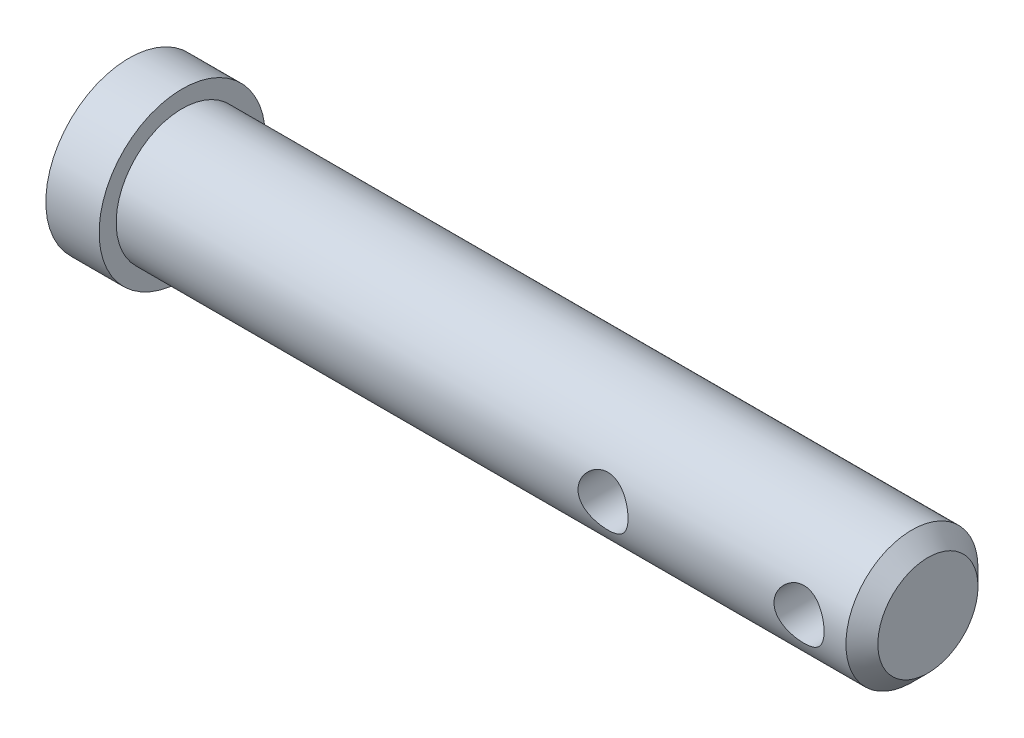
ISO-10303-21;
HEADER;
FILE_DESCRIPTION(('STEP AP214'),'2;1');
FILE_NAME('part.step','',(''),(''),'','','');
FILE_SCHEMA(('AUTOMOTIVE_DESIGN { 1 0 10303 214 1 1 1 1 }'));
ENDSEC;
DATA;
#1=APPLICATION_CONTEXT('core data for automotive mechanical design processes');
#2=APPLICATION_PROTOCOL_DEFINITION('international standard','automotive_design',2000,#1);
#3=PRODUCT_CONTEXT('',#1,'mechanical');
#4=PRODUCT('Part','Part','',(#3));
#5=PRODUCT_RELATED_PRODUCT_CATEGORY('part','',(#4));
#6=PRODUCT_DEFINITION_FORMATION('','',#4);
#7=PRODUCT_DEFINITION_CONTEXT('part definition',#1,'design');
#8=PRODUCT_DEFINITION('design','',#6,#7);
#9=PRODUCT_DEFINITION_SHAPE('','',#8);
#10=(LENGTH_UNIT() NAMED_UNIT(*) SI_UNIT(.MILLI.,.METRE.));
#11=(NAMED_UNIT(*) PLANE_ANGLE_UNIT() SI_UNIT($,.RADIAN.));
#12=(NAMED_UNIT(*) SI_UNIT($,.STERADIAN.) SOLID_ANGLE_UNIT());
#13=UNCERTAINTY_MEASURE_WITH_UNIT(LENGTH_MEASURE(1.E-05),#10,'distance_accuracy_value','');
#14=(GEOMETRIC_REPRESENTATION_CONTEXT(3) GLOBAL_UNCERTAINTY_ASSIGNED_CONTEXT((#13)) GLOBAL_UNIT_ASSIGNED_CONTEXT((#10,
#11,#12)) REPRESENTATION_CONTEXT('',''));
#15=CARTESIAN_POINT('',(0.,0.,0.));
#16=DIRECTION('',(0.,0.,1.));
#17=DIRECTION('',(1.,0.,0.));
#18=AXIS2_PLACEMENT_3D('',#15,#16,#17);
#19=CARTESIAN_POINT('',(19.05,3.14959999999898,-9.43689570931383E-13));
#20=DIRECTION('',(1.,0.,0.));
#21=DIRECTION('',(0.,0.,-1.));
#22=AXIS2_PLACEMENT_3D('',#19,#20,#21);
#23=PLANE('',#22);
#24=CARTESIAN_POINT('',(19.05,-5.55111512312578E-13,-2.22044604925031E-13));
#25=DIRECTION('',(1.,0.,0.));
#26=DIRECTION('',(0.,0.,-1.));
#27=AXIS2_PLACEMENT_3D('',#24,#25,#26);
#28=CIRCLE('',#27,2.38759999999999);
#29=CARTESIAN_POINT('',(19.05,-5.55405581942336E-13,-2.38760000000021));
#30=VERTEX_POINT('',#29);
#31=EDGE_CURVE('E36',#30,#30,#28,.T.);
#32=ORIENTED_EDGE('',*,*,#31,.T.);
#33=EDGE_LOOP('',(#32));
#34=FACE_BOUND('',#33,.T.);
#35=ADVANCED_FACE('F30',(#34),#23,.T.);
#36=CARTESIAN_POINT('',(-19.05,-4.44089209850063E-13,1.66533453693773E-13));
#37=DIRECTION('',(1.,0.,0.));
#38=DIRECTION('',(0.,0.,-1.));
#39=AXIS2_PLACEMENT_3D('',#36,#37,#38);
#40=CYLINDRICAL_SURFACE('',#39,3.1496);
#41=CARTESIAN_POINT('',(18.2880000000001,-2.22044604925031E-13,2.22044604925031E-13));
#42=DIRECTION('',(1.,0.,0.));
#43=DIRECTION('',(0.,0.,-1.));
#44=AXIS2_PLACEMENT_3D('',#41,#42,#43);
#45=CIRCLE('',#44,3.1496);
#46=CARTESIAN_POINT('',(18.2880000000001,-2.22432526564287E-13,-3.14959999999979));
#47=VERTEX_POINT('',#46);
#48=EDGE_CURVE('E10',#47,#47,#45,.F.);
#49=ORIENTED_EDGE('',*,*,#48,.T.);
#50=EDGE_LOOP('',(#49));
#51=FACE_BOUND('',#50,.T.);
#52=CARTESIAN_POINT('',(5.51180000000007,5.55111512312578E-13,-3.14960000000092));
#53=CARTESIAN_POINT('',(5.51179744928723,0.0646027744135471,-3.14960192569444));
#54=CARTESIAN_POINT('',(5.51706029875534,0.129188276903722,-3.14759517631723));
#55=CARTESIAN_POINT('',(5.53788524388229,0.256426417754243,-3.13979076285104));
#56=CARTESIAN_POINT('',(5.5534456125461,0.319079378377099,-3.133993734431));
#57=CARTESIAN_POINT('',(5.59423439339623,0.440598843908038,-3.11923020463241));
#58=CARTESIAN_POINT('',(5.61944390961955,0.49947248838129,-3.11026990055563));
#59=CARTESIAN_POINT('',(5.67871818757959,0.612150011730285,-3.09007009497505));
#60=CARTESIAN_POINT('',(5.71278537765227,0.665952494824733,-3.0788299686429));
#61=CARTESIAN_POINT('',(5.79034597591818,0.769287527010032,-3.05468541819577));
#62=CARTESIAN_POINT('',(5.83415509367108,0.81857183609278,-3.04173319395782));
#63=CARTESIAN_POINT('',(5.92928575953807,0.909294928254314,-3.01585684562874));
#64=CARTESIAN_POINT('',(5.98060967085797,0.950731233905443,-3.00293273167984));
#65=CARTESIAN_POINT('',(6.09175844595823,1.0261778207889,-2.97801651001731));
#66=CARTESIAN_POINT('',(6.15183718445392,1.05983451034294,-2.96608058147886));
#67=CARTESIAN_POINT('',(6.27732573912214,1.11645520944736,-2.94523768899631));
#68=CARTESIAN_POINT('',(6.34273336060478,1.13942359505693,-2.93632948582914));
#69=CARTESIAN_POINT('',(6.47416313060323,1.17303084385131,-2.92306258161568));
#70=CARTESIAN_POINT('',(6.54004575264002,1.18414418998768,-2.91852955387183));
#71=CARTESIAN_POINT('',(6.6728847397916,1.19520928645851,-2.91401686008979));
#72=CARTESIAN_POINT('',(6.73984063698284,1.19516577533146,-2.9140352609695));
#73=CARTESIAN_POINT('',(6.86855091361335,1.18428068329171,-2.91847329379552));
#74=CARTESIAN_POINT('',(6.9303723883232,1.1741017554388,-2.92262282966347));
#75=CARTESIAN_POINT('',(7.05135361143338,1.14433173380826,-2.93440600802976));
#76=CARTESIAN_POINT('',(7.11051294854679,1.12473919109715,-2.94204018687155));
#77=CARTESIAN_POINT('',(7.22582555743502,1.07634099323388,-2.96009220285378));
#78=CARTESIAN_POINT('',(7.28189944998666,1.04736590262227,-2.97056060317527));
#79=CARTESIAN_POINT('',(7.38857972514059,0.981143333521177,-2.99308517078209));
#80=CARTESIAN_POINT('',(7.43918418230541,0.943892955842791,-3.00514189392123));
#81=CARTESIAN_POINT('',(7.53715078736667,0.859161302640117,-3.03049594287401));
#82=CARTESIAN_POINT('',(7.58405054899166,0.811152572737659,-3.04382156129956));
#83=CARTESIAN_POINT('',(7.66927249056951,0.707799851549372,-3.06950029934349));
#84=CARTESIAN_POINT('',(7.70759329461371,0.652454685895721,-3.08185326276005));
#85=CARTESIAN_POINT('',(7.77509437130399,0.534800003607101,-3.10444997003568));
#86=CARTESIAN_POINT('',(7.80411751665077,0.472392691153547,-3.11465654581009));
#87=CARTESIAN_POINT('',(7.85109874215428,0.34309783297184,-3.13153396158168));
#88=CARTESIAN_POINT('',(7.8690618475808,0.276212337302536,-3.13820640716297));
#89=CARTESIAN_POINT('',(7.89251690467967,0.143748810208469,-3.14697988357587));
#90=CARTESIAN_POINT('',(7.89863130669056,0.0782959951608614,-3.14930882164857));
#91=CARTESIAN_POINT('',(7.90003185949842,-0.052734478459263,-3.14983931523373));
#92=CARTESIAN_POINT('',(7.89532047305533,-0.118312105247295,-3.1480418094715));
#93=CARTESIAN_POINT('',(7.8756739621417,-0.245020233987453,-3.14067159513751));
#94=CARTESIAN_POINT('',(7.86114929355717,-0.306224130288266,-3.13525054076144));
#95=CARTESIAN_POINT('',(7.82283179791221,-0.425281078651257,-3.12133165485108));
#96=CARTESIAN_POINT('',(7.79903776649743,-0.483133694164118,-3.11283342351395));
#97=CARTESIAN_POINT('',(7.74209429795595,-0.595766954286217,-3.09328428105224));
#98=CARTESIAN_POINT('',(7.70868868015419,-0.650405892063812,-3.08216522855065));
#99=CARTESIAN_POINT('',(7.63375898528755,-0.753487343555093,-3.05860055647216));
#100=CARTESIAN_POINT('',(7.59223186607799,-0.801927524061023,-3.04615444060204));
#101=CARTESIAN_POINT('',(7.49934212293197,-0.894242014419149,-3.02038801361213));
#102=CARTESIAN_POINT('',(7.44754232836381,-0.937675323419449,-3.00705962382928));
#103=CARTESIAN_POINT('',(7.3371312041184,-1.01532345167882,-2.98173962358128));
#104=CARTESIAN_POINT('',(7.27851919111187,-1.04953734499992,-2.96974814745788));
#105=CARTESIAN_POINT('',(7.15560507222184,-1.10783601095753,-2.94849998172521));
#106=CARTESIAN_POINT('',(7.09127627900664,-1.13186989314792,-2.93925709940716));
#107=CARTESIAN_POINT('',(6.95903516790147,-1.16860186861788,-2.92484984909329));
#108=CARTESIAN_POINT('',(6.8911251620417,-1.1813071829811,-2.91968288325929));
#109=CARTESIAN_POINT('',(6.7584394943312,-1.19436874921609,-2.91436244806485));
#110=CARTESIAN_POINT('',(6.69374975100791,-1.19547910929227,-2.91390286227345));
#111=CARTESIAN_POINT('',(6.56515652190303,-1.18725889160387,-2.91726170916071));
#112=CARTESIAN_POINT('',(6.50125295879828,-1.17792934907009,-2.92107971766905));
#113=CARTESIAN_POINT('',(6.37811599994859,-1.14968605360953,-2.93230629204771));
#114=CARTESIAN_POINT('',(6.31879867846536,-1.1310871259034,-2.93959658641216));
#115=CARTESIAN_POINT('',(6.20409343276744,-1.08511296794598,-2.95687505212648));
#116=CARTESIAN_POINT('',(6.14870651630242,-1.05773549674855,-2.96686391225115));
#117=CARTESIAN_POINT('',(6.04022782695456,-0.99329135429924,-2.98907532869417));
#118=CARTESIAN_POINT('',(5.98741515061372,-0.955786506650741,-3.00138848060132));
#119=CARTESIAN_POINT('',(5.88859243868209,-0.872824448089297,-3.02655500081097));
#120=CARTESIAN_POINT('',(5.84258459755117,-0.827364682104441,-3.03940854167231));
#121=CARTESIAN_POINT('',(5.75605923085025,-0.726754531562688,-3.06506862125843));
#122=CARTESIAN_POINT('',(5.71599093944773,-0.671205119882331,-3.07783256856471));
#123=CARTESIAN_POINT('',(5.64576712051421,-0.553711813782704,-3.10112358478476));
#124=CARTESIAN_POINT('',(5.61561273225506,-0.491767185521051,-3.11165039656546));
#125=CARTESIAN_POINT('',(5.56499897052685,-0.359773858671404,-3.12972838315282));
#126=CARTESIAN_POINT('',(5.54513097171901,-0.289470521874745,-3.13709455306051));
#127=CARTESIAN_POINT('',(5.51853641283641,-0.146103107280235,-3.14702800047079));
#128=CARTESIAN_POINT('',(5.51180288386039,-0.0730405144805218,-3.14959782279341));
#129=CARTESIAN_POINT('',(5.51180000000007,5.55111512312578E-13,-3.14960000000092));
#130=B_SPLINE_CURVE_WITH_KNOTS('',3,(#52,#53,#54,#55,#56,#57,#58,#59,#60,#61,#62,#63,#64,#65,
#66,#67,#68,#69,#70,#71,#72,#73,#74,#75,#76,#77,#78,#79,#80,#81,#82,#83,#84,#85,#86,#87,#88,#89,
#90,#91,#92,#93,#94,#95,#96,#97,#98,#99,#100,#101,#102,#103,#104,#105,#106,#107,#108,#109,#110,
#111,#112,#113,#114,#115,#116,#117,#118,#119,#120,#121,#122,#123,#124,#125,#126,#127,#128,#129),
.UNSPECIFIED.,.T.,.F.,(4,2,2,2,2,2,2,2,2,2,2,2,2,2,2,2,2,2,2,2,2,2,2,2,2,2,2,2,2,2,2,2,2,2,2,2,
2,2,4),(0.,0.193538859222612,0.387045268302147,0.580174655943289,0.773357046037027,
0.974070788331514,1.17484778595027,1.38347301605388,1.59201275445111,1.79185075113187,
1.99160387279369,2.17910162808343,2.36662825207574,2.55775020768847,2.74893922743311,
2.95327797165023,3.157649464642,3.3653119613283,3.57288003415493,3.76921205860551,
3.96549942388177,4.1540470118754,4.34261910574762,4.5367754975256,4.73100475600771,
4.9367500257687,5.1425159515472,5.34929870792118,5.55594956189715,5.74906955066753,
5.94217039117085,6.12911899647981,6.31611536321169,6.5130653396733,6.71007869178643,
6.91807839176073,7.12610198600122,7.34503506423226,7.56385194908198),.UNSPECIFIED.);
#131=CARTESIAN_POINT('',(5.51180000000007,5.55111512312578E-13,-3.14960000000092));
#132=VERTEX_POINT('',#131);
#133=EDGE_CURVE('E47',#132,#132,#130,.T.);
#134=ORIENTED_EDGE('',*,*,#133,.F.);
#135=EDGE_LOOP('',(#134));
#136=FACE_BOUND('',#135,.T.);
#137=CARTESIAN_POINT('',(7.89940000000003,-1.11022302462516E-13,3.14959999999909));
#138=CARTESIAN_POINT('',(7.89940255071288,0.0646027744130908,3.14960192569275));
#139=CARTESIAN_POINT('',(7.89413970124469,0.129188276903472,3.14759517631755));
#140=CARTESIAN_POINT('',(7.87331475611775,0.256426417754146,3.13979076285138));
#141=CARTESIAN_POINT('',(7.85775438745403,0.319079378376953,3.13399373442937));
#142=CARTESIAN_POINT('',(7.81696560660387,0.440598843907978,3.11923020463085));
#143=CARTESIAN_POINT('',(7.79175609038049,0.499472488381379,3.11026990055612));
#144=CARTESIAN_POINT('',(7.73248181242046,0.612150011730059,3.09007009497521));
#145=CARTESIAN_POINT('',(7.69841462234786,0.665952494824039,3.07882996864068));
#146=CARTESIAN_POINT('',(7.62085402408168,0.769287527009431,3.05468541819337));
#147=CARTESIAN_POINT('',(7.57704490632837,0.818571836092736,3.04173319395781));
#148=CARTESIAN_POINT('',(7.48191424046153,0.909294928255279,3.01585684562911));
#149=CARTESIAN_POINT('',(7.4305903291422,0.950731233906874,3.00293273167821));
#150=CARTESIAN_POINT('',(7.31944155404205,1.02617782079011,2.97801651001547));
#151=CARTESIAN_POINT('',(7.25936281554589,1.0598345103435,2.96608058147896));
#152=CARTESIAN_POINT('',(7.1338742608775,1.11645520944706,2.94523768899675));
#153=CARTESIAN_POINT('',(7.06846663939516,1.1394235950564,2.93632948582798));
#154=CARTESIAN_POINT('',(6.9370368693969,1.17303084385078,2.9230625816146));
#155=CARTESIAN_POINT('',(6.87115424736,1.18414418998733,2.91852955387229));
#156=CARTESIAN_POINT('',(6.73831526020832,1.19520928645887,2.91401686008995));
#157=CARTESIAN_POINT('',(6.67135936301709,1.19516577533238,2.9140352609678));
#158=CARTESIAN_POINT('',(6.54264908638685,1.18428068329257,2.91847329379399));
#159=CARTESIAN_POINT('',(6.48082761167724,1.1741017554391,2.92262282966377));
#160=CARTESIAN_POINT('',(6.35984638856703,1.14433173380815,2.93440600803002));
#161=CARTESIAN_POINT('',(6.30068705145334,1.12473919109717,2.94204018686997));
#162=CARTESIAN_POINT('',(6.18537444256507,1.07634099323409,2.96009220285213));
#163=CARTESIAN_POINT('',(6.12930055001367,1.04736590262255,2.97056060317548));
#164=CARTESIAN_POINT('',(6.02262027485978,0.981143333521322,2.99308517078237));
#165=CARTESIAN_POINT('',(5.97201581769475,0.943892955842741,3.00514189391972));
#166=CARTESIAN_POINT('',(5.87404921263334,0.859161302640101,3.03049594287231));
#167=CARTESIAN_POINT('',(5.82714945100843,0.811152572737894,3.04382156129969));
#168=CARTESIAN_POINT('',(5.74192750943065,0.707799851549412,3.06950029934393));
#169=CARTESIAN_POINT('',(5.70360670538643,0.652454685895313,3.08185326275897));
#170=CARTESIAN_POINT('',(5.63610562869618,0.534800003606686,3.10444997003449));
#171=CARTESIAN_POINT('',(5.60708248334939,0.472392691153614,3.11465654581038));
#172=CARTESIAN_POINT('',(5.56010125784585,0.34309783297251,3.13153396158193));
#173=CARTESIAN_POINT('',(5.54213815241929,0.276212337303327,3.13820640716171));
#174=CARTESIAN_POINT('',(5.51868309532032,0.143748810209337,3.14697988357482));
#175=CARTESIAN_POINT('',(5.51256869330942,0.0782959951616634,3.14930882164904));
#176=CARTESIAN_POINT('',(5.51116814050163,-0.0527344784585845,3.14983931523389));
#177=CARTESIAN_POINT('',(5.5158795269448,-0.118312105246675,3.1480418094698));
#178=CARTESIAN_POINT('',(5.53552603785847,-0.245020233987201,3.14067159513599));
#179=CARTESIAN_POINT('',(5.55005070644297,-0.306224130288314,3.13525054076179));
#180=CARTESIAN_POINT('',(5.58836820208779,-0.425281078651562,3.12133165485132));
#181=CARTESIAN_POINT('',(5.61216223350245,-0.483133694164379,3.11283342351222));
#182=CARTESIAN_POINT('',(5.66910570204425,-0.595766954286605,3.0932842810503));
#183=CARTESIAN_POINT('',(5.70251131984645,-0.650405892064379,3.08216522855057));
#184=CARTESIAN_POINT('',(5.777441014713,-0.75348734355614,3.05860055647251));
#185=CARTESIAN_POINT('',(5.81896813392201,-0.801927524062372,3.04615444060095));
#186=CARTESIAN_POINT('',(5.91185787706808,-0.894242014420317,3.02038801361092));
#187=CARTESIAN_POINT('',(5.96365767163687,-0.937675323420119,3.00705962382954));
#188=CARTESIAN_POINT('',(6.07406879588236,-1.01532345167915,2.98173962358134));
#189=CARTESIAN_POINT('',(6.13268080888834,-1.04953734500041,2.96974814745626));
#190=CARTESIAN_POINT('',(6.2555949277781,-1.10783601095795,2.9484999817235));
#191=CARTESIAN_POINT('',(6.3199237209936,-1.13186989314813,2.93925709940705));
#192=CARTESIAN_POINT('',(6.45216483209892,-1.16860186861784,2.92484984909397));
#193=CARTESIAN_POINT('',(6.52007483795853,-1.18130718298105,2.91968288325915));
#194=CARTESIAN_POINT('',(6.65276050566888,-1.19436874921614,2.91436244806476));
#195=CARTESIAN_POINT('',(6.71745024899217,-1.19547910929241,2.91390286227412));
#196=CARTESIAN_POINT('',(6.84604347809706,-1.18725889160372,2.91726170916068));
#197=CARTESIAN_POINT('',(6.90994704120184,-1.17792934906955,2.92107971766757));
#198=CARTESIAN_POINT('',(7.03308400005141,-1.14968605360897,2.93230629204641));
#199=CARTESIAN_POINT('',(7.09240132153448,-1.1310871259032,2.9395965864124));
#200=CARTESIAN_POINT('',(7.20710656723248,-1.08511296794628,2.95687505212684));
#201=CARTESIAN_POINT('',(7.26249348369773,-1.05773549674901,2.96686391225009));
#202=CARTESIAN_POINT('',(7.37097217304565,-0.993291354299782,2.98907532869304));
#203=CARTESIAN_POINT('',(7.42378484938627,-0.955786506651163,3.00138848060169));
#204=CARTESIAN_POINT('',(7.52260756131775,-0.872824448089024,3.0265550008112));
#205=CARTESIAN_POINT('',(7.56861540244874,-0.827364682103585,3.0394085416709));
#206=CARTESIAN_POINT('',(7.65514076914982,-0.726754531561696,3.06506862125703));
#207=CARTESIAN_POINT('',(7.69520906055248,-0.67120511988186,3.07783256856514));
#208=CARTESIAN_POINT('',(7.76543287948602,-0.553711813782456,3.10112358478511));
#209=CARTESIAN_POINT('',(7.79558726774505,-0.491767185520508,3.11165039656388));
#210=CARTESIAN_POINT('',(7.8462010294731,-0.359773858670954,3.12972838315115));
#211=CARTESIAN_POINT('',(7.86606902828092,-0.289470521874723,3.1370945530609));
#212=CARTESIAN_POINT('',(7.89266358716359,-0.146103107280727,3.147028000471));
#213=CARTESIAN_POINT('',(7.89939711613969,-0.0730405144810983,3.14959782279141));
#214=CARTESIAN_POINT('',(7.89940000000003,-1.11022302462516E-13,3.14959999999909));
#215=B_SPLINE_CURVE_WITH_KNOTS('',3,(#137,#138,#139,#140,#141,#142,#143,#144,#145,#146,#147,
#148,#149,#150,#151,#152,#153,#154,#155,#156,#157,#158,#159,#160,#161,#162,#163,#164,#165,#166,
#167,#168,#169,#170,#171,#172,#173,#174,#175,#176,#177,#178,#179,#180,#181,#182,#183,#184,#185,
#186,#187,#188,#189,#190,#191,#192,#193,#194,#195,#196,#197,#198,#199,#200,#201,#202,#203,#204,
#205,#206,#207,#208,#209,#210,#211,#212,#213,#214),.UNSPECIFIED.,.T.,.F.,(4,2,2,2,2,2,2,2,2,2,2,
2,2,2,2,2,2,2,2,2,2,2,2,2,2,2,2,2,2,2,2,2,2,2,2,2,2,2,4),(0.,0.193538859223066,
0.387045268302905,0.580174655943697,0.773357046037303,0.974070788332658,1.17484778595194,
1.38347301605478,1.59201275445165,1.79185075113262,1.99160387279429,2.17910162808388,
2.3666282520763,2.55775020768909,2.74893922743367,2.95327797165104,3.15764946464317,
3.36531196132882,3.57288003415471,3.7692120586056,3.96549942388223,4.15404701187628,
4.34261910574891,4.53677549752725,4.73100475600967,4.93675002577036,5.14251595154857,
5.34929870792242,5.55594956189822,5.74906955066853,5.94217039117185,6.12911899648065,
6.31611536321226,6.51306533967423,6.7100786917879,6.91807839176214,7.12610198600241,
7.34503506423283,7.56385194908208),.UNSPECIFIED.);
#216=CARTESIAN_POINT('',(7.89940000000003,-1.11022302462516E-13,3.14959999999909));
#217=VERTEX_POINT('',#216);
#218=EDGE_CURVE('E55',#217,#217,#215,.T.);
#219=ORIENTED_EDGE('',*,*,#218,.F.);
#220=EDGE_LOOP('',(#219));
#221=FACE_BOUND('',#220,.T.);
#222=CARTESIAN_POINT('',(14.8590000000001,0.,-3.14960000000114));
#223=CARTESIAN_POINT('',(14.8589974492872,0.0646027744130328,-3.14960192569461));
#224=CARTESIAN_POINT('',(14.8642602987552,0.129188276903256,-3.14759517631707));
#225=CARTESIAN_POINT('',(14.8850852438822,0.256426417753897,-3.13979076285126));
#226=CARTESIAN_POINT('',(14.9006456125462,0.319079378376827,-3.13399373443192));
#227=CARTESIAN_POINT('',(14.9414343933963,0.440598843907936,-3.11923020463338));
#228=CARTESIAN_POINT('',(14.9666439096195,0.499472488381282,-3.11026990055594));
#229=CARTESIAN_POINT('',(15.0259181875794,0.612150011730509,-3.0900700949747));
#230=CARTESIAN_POINT('',(15.0599853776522,0.665952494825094,-3.07882996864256));
#231=CARTESIAN_POINT('',(15.1375459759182,0.769287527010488,-3.05468541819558));
#232=CARTESIAN_POINT('',(15.1813550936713,0.818571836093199,-3.04173319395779));
#233=CARTESIAN_POINT('',(15.2764857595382,0.909294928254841,-3.0158568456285));
#234=CARTESIAN_POINT('',(15.327809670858,0.950731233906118,-3.00293273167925));
#235=CARTESIAN_POINT('',(15.4389584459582,1.02617782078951,-2.9780165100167));
#236=CARTESIAN_POINT('',(15.499037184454,1.05983451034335,-2.96608058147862));
#237=CARTESIAN_POINT('',(15.6245257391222,1.11645520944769,-2.94523768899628));
#238=CARTESIAN_POINT('',(15.6899333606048,1.13942359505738,-2.93632948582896));
#239=CARTESIAN_POINT('',(15.8213631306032,1.17303084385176,-2.92306258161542));
#240=CARTESIAN_POINT('',(15.88724575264,1.18414418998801,-2.91852955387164));
#241=CARTESIAN_POINT('',(16.0200847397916,1.19520928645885,-2.9140168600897));
#242=CARTESIAN_POINT('',(16.0870406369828,1.19516577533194,-2.91403526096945));
#243=CARTESIAN_POINT('',(16.2157509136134,1.18428068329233,-2.91847329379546));
#244=CARTESIAN_POINT('',(16.2775723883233,1.17410175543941,-2.9226228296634));
#245=CARTESIAN_POINT('',(16.3985536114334,1.14433173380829,-2.93440600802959));
#246=CARTESIAN_POINT('',(16.4577129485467,1.1247391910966,-2.94204018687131));
#247=CARTESIAN_POINT('',(16.5730255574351,1.07634099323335,-2.96009220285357));
#248=CARTESIAN_POINT('',(16.6290994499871,1.04736590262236,-2.97056060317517));
#249=CARTESIAN_POINT('',(16.7357797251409,0.981143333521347,-2.99308517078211));
#250=CARTESIAN_POINT('',(16.7863841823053,0.943892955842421,-3.00514189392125));
#251=CARTESIAN_POINT('',(16.8843507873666,0.859161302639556,-3.030495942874));
#252=CARTESIAN_POINT('',(16.931250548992,0.811152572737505,-3.04382156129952));
#253=CARTESIAN_POINT('',(17.0164724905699,0.707799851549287,-3.0695002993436));
#254=CARTESIAN_POINT('',(17.0547932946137,0.652454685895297,-3.08185326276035));
#255=CARTESIAN_POINT('',(17.1222943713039,0.534800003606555,-3.10444997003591));
#256=CARTESIAN_POINT('',(17.1513175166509,0.472392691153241,-3.11465654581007));
#257=CARTESIAN_POINT('',(17.1982987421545,0.343097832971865,-3.13153396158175));
#258=CARTESIAN_POINT('',(17.2162618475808,0.276212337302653,-3.13820640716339));
#259=CARTESIAN_POINT('',(17.2397169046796,0.143748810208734,-3.14697988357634));
#260=CARTESIAN_POINT('',(17.2458313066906,0.0782959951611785,-3.14930882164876));
#261=CARTESIAN_POINT('',(17.2472318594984,-0.0527344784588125,-3.14983931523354));
#262=CARTESIAN_POINT('',(17.2425204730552,-0.118312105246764,-3.14804180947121));
#263=CARTESIAN_POINT('',(17.2228739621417,-0.24502023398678,-3.14067159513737));
#264=CARTESIAN_POINT('',(17.2083492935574,-0.306224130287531,-3.13525054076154));
#265=CARTESIAN_POINT('',(17.1700317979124,-0.425281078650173,-3.1213316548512));
#266=CARTESIAN_POINT('',(17.1462377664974,-0.483133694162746,-3.11283342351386));
#267=CARTESIAN_POINT('',(17.089294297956,-0.595766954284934,-3.09328428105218));
#268=CARTESIAN_POINT('',(17.0558886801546,-0.650405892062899,-3.08216522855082));
#269=CARTESIAN_POINT('',(16.9809589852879,-0.75348734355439,-3.05860055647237));
#270=CARTESIAN_POINT('',(16.9394318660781,-0.801927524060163,-3.04615444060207));
#271=CARTESIAN_POINT('',(16.846542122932,-0.894242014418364,-3.02038801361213));
#272=CARTESIAN_POINT('',(16.7947423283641,-0.937675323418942,-3.00705962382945));
#273=CARTESIAN_POINT('',(16.6843312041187,-1.0153234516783,-2.98173962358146));
#274=CARTESIAN_POINT('',(16.625719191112,-1.0495373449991,-2.96974814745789));
#275=CARTESIAN_POINT('',(16.5028050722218,-1.10783601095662,-2.94849998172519));
#276=CARTESIAN_POINT('',(16.4384762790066,-1.13186989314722,-2.93925709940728));
#277=CARTESIAN_POINT('',(16.3062351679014,-1.16860186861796,-2.92484984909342));
#278=CARTESIAN_POINT('',(16.2383251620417,-1.18130718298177,-2.91968288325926));
#279=CARTESIAN_POINT('',(16.1056394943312,-1.19436874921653,-2.91436244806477));
#280=CARTESIAN_POINT('',(16.040949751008,-1.19547910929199,-2.91390286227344));
#281=CARTESIAN_POINT('',(15.9123565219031,-1.1872588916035,-2.917261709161));
#282=CARTESIAN_POINT('',(15.8484529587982,-1.17792934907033,-2.92107971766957));
#283=CARTESIAN_POINT('',(15.7253159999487,-1.14968605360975,-2.93230629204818));
#284=CARTESIAN_POINT('',(15.6659986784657,-1.13108712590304,-2.93959658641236));
#285=CARTESIAN_POINT('',(15.5512934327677,-1.08511296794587,-2.95687505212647));
#286=CARTESIAN_POINT('',(15.4959065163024,-1.05773549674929,-2.9668639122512));
#287=CARTESIAN_POINT('',(15.3874278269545,-0.993291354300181,-2.98907532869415));
#288=CARTESIAN_POINT('',(15.334615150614,-0.95578650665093,-3.00138848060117));
#289=CARTESIAN_POINT('',(15.2357924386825,-0.872824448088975,-3.02655500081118));
#290=CARTESIAN_POINT('',(15.1897845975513,-0.827364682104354,-3.03940854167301));
#291=CARTESIAN_POINT('',(15.1032592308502,-0.726754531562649,-3.06506862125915));
#292=CARTESIAN_POINT('',(15.0631909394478,-0.671205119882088,-3.07783256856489));
#293=CARTESIAN_POINT('',(14.9929671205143,-0.55371181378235,-3.10112358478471));
#294=CARTESIAN_POINT('',(14.9628127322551,-0.49176718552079,-3.11165039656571));
#295=CARTESIAN_POINT('',(14.9121989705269,-0.359773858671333,-3.1297283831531));
#296=CARTESIAN_POINT('',(14.8923309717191,-0.289470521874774,-3.13709455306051));
#297=CARTESIAN_POINT('',(14.8657364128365,-0.146103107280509,-3.14702800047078));
#298=CARTESIAN_POINT('',(14.8590028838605,-0.0730405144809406,-3.14959782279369));
#299=CARTESIAN_POINT('',(14.8590000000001,0.,-3.14960000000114));
#300=B_SPLINE_CURVE_WITH_KNOTS('',3,(#222,#223,#224,#225,#226,#227,#228,#229,#230,#231,#232,
#233,#234,#235,#236,#237,#238,#239,#240,#241,#242,#243,#244,#245,#246,#247,#248,#249,#250,#251,
#252,#253,#254,#255,#256,#257,#258,#259,#260,#261,#262,#263,#264,#265,#266,#267,#268,#269,#270,
#271,#272,#273,#274,#275,#276,#277,#278,#279,#280,#281,#282,#283,#284,#285,#286,#287,#288,#289,
#290,#291,#292,#293,#294,#295,#296,#297,#298,#299),.UNSPECIFIED.,.T.,.F.,(4,2,2,2,2,2,2,2,2,2,2,
2,2,2,2,2,2,2,2,2,2,2,2,2,2,2,2,2,2,2,2,2,2,2,2,2,2,2,4),(0.,0.19353885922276,0.387045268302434,
0.580174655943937,0.773357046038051,0.974070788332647,1.17484778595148,1.38347301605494,
1.59201275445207,1.79185075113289,1.99160387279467,2.17910162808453,2.36662825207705,
2.55775020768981,2.74893922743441,2.95327797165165,3.15764946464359,3.36531196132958,
3.57288003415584,3.76921205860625,3.96549942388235,4.15404701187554,4.34261910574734,
4.53677549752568,4.73100475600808,4.93675002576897,5.14251595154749,5.34929870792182,
5.55594956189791,5.74906955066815,5.94217039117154,6.12911899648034,6.3161153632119,
6.51306533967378,6.71007869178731,6.91807839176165,7.1261019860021,7.34503506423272,
7.56385194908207),.UNSPECIFIED.);
#301=CARTESIAN_POINT('',(14.8590000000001,0.,-3.14960000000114));
#302=VERTEX_POINT('',#301);
#303=EDGE_CURVE('E83',#302,#302,#300,.T.);
#304=ORIENTED_EDGE('',*,*,#303,.F.);
#305=EDGE_LOOP('',(#304));
#306=FACE_BOUND('',#305,.T.);
#307=CARTESIAN_POINT('',(17.2466,-2.22044604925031E-13,3.14959999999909));
#308=CARTESIAN_POINT('',(17.2466025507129,0.0646027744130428,3.14960192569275));
#309=CARTESIAN_POINT('',(17.2413397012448,0.129188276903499,3.14759517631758));
#310=CARTESIAN_POINT('',(17.2205147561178,0.256426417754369,3.13979076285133));
#311=CARTESIAN_POINT('',(17.204954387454,0.319079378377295,3.13399373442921));
#312=CARTESIAN_POINT('',(17.1641656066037,0.440598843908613,3.11923020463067));
#313=CARTESIAN_POINT('',(17.1389560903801,0.499472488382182,3.11026990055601));
#314=CARTESIAN_POINT('',(17.0796818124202,0.612150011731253,3.09007009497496));
#315=CARTESIAN_POINT('',(17.0456146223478,0.665952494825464,3.07882996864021));
#316=CARTESIAN_POINT('',(16.968054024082,0.769287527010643,3.05468541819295));
#317=CARTESIAN_POINT('',(16.9242449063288,0.818571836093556,3.04173319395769));
#318=CARTESIAN_POINT('',(16.8291142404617,0.909294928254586,3.0158568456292));
#319=CARTESIAN_POINT('',(16.7777903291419,0.950731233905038,3.00293273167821));
#320=CARTESIAN_POINT('',(16.6666415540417,1.02617782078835,2.97801651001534));
#321=CARTESIAN_POINT('',(16.6065628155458,1.05983451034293,2.96608058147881));
#322=CARTESIAN_POINT('',(16.4810742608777,1.1164552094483,2.94523768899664));
#323=CARTESIAN_POINT('',(16.4156666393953,1.1394235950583,2.93632948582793));
#324=CARTESIAN_POINT('',(16.284236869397,1.17303084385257,2.92306258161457));
#325=CARTESIAN_POINT('',(16.2183542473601,1.18414418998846,2.91852955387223));
#326=CARTESIAN_POINT('',(16.0855152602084,1.19520928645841,2.91401686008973));
#327=CARTESIAN_POINT('',(16.0185593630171,1.19516577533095,2.91403526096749));
#328=CARTESIAN_POINT('',(15.8898490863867,1.18428068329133,2.91847329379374));
#329=CARTESIAN_POINT('',(15.828027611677,1.17410175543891,2.92262282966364));
#330=CARTESIAN_POINT('',(15.7070463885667,1.14433173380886,2.93440600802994));
#331=CARTESIAN_POINT('',(15.6478870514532,1.12473919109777,2.94204018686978));
#332=CARTESIAN_POINT('',(15.5325744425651,1.07634099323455,2.9600922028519));
#333=CARTESIAN_POINT('',(15.4765005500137,1.04736590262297,2.9705606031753));
#334=CARTESIAN_POINT('',(15.3698202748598,0.981143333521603,2.99308517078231));
#335=CARTESIAN_POINT('',(15.3192158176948,0.943892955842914,3.00514189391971));
#336=CARTESIAN_POINT('',(15.2212492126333,0.859161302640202,3.03049594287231));
#337=CARTESIAN_POINT('',(15.1743494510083,0.811152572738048,3.04382156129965));
#338=CARTESIAN_POINT('',(15.0891275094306,0.707799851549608,3.06950029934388));
#339=CARTESIAN_POINT('',(15.0508067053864,0.652454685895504,3.08185326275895));
#340=CARTESIAN_POINT('',(14.9833056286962,0.534800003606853,3.10444997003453));
#341=CARTESIAN_POINT('',(14.9542824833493,0.472392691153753,3.11465654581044));
#342=CARTESIAN_POINT('',(14.9073012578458,0.343097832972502,3.13153396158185));
#343=CARTESIAN_POINT('',(14.8893381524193,0.2762123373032,3.13820640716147));
#344=CARTESIAN_POINT('',(14.8658830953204,0.143748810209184,3.14697988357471));
#345=CARTESIAN_POINT('',(14.8597686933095,0.0782959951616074,3.14930882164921));
#346=CARTESIAN_POINT('',(14.8583681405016,-0.0527344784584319,3.14983931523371));
#347=CARTESIAN_POINT('',(14.8630795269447,-0.11831210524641,3.14804180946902));
#348=CARTESIAN_POINT('',(14.8827260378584,-0.245020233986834,3.14067159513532));
#349=CARTESIAN_POINT('',(14.8972507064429,-0.306224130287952,3.13525054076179));
#350=CARTESIAN_POINT('',(14.9355682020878,-0.425281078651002,3.12133165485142));
#351=CARTESIAN_POINT('',(14.9593622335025,-0.483133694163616,3.11283342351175));
#352=CARTESIAN_POINT('',(15.0163057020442,-0.595766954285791,3.09328428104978));
#353=CARTESIAN_POINT('',(15.0497113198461,-0.650405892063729,3.08216522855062));
#354=CARTESIAN_POINT('',(15.1246410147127,-0.753487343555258,3.0586005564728));
#355=CARTESIAN_POINT('',(15.166168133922,-0.801927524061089,3.04615444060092));
#356=CARTESIAN_POINT('',(15.2590578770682,-0.894242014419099,3.0203880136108));
#357=CARTESIAN_POINT('',(15.3108576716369,-0.937675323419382,3.00705962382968));
#358=CARTESIAN_POINT('',(15.4212687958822,-1.01532345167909,2.98173962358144));
#359=CARTESIAN_POINT('',(15.4798808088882,-1.04953734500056,2.96974814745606));
#360=CARTESIAN_POINT('',(15.602794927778,-1.10783601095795,2.94849998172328));
#361=CARTESIAN_POINT('',(15.6671237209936,-1.13186989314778,2.93925709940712));
#362=CARTESIAN_POINT('',(15.7993648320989,-1.16860186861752,2.92484984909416));
#363=CARTESIAN_POINT('',(15.8672748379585,-1.18130718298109,2.91968288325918));
#364=CARTESIAN_POINT('',(15.9999605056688,-1.19436874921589,2.91436244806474));
#365=CARTESIAN_POINT('',(16.0646502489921,-1.19547910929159,2.91390286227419));
#366=CARTESIAN_POINT('',(16.1932434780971,-1.18725889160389,2.91726170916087));
#367=CARTESIAN_POINT('',(16.2571470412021,-1.17792934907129,2.92107971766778));
#368=CARTESIAN_POINT('',(16.3802840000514,-1.14968605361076,2.93230629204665));
#369=CARTESIAN_POINT('',(16.439601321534,-1.13108712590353,2.93959658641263));
#370=CARTESIAN_POINT('',(16.554306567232,-1.08511296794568,2.95687505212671));
#371=CARTESIAN_POINT('',(16.6096934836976,-1.05773549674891,2.96686391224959));
#372=CARTESIAN_POINT('',(16.7181721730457,-0.993291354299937,2.98907532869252));
#373=CARTESIAN_POINT('',(16.770984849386,-0.955786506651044,3.00138848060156));
#374=CARTESIAN_POINT('',(16.8698075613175,-0.872824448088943,3.02655500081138));
#375=CARTESIAN_POINT('',(16.9158154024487,-0.827364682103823,3.039408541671));
#376=CARTESIAN_POINT('',(17.0023407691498,-0.72675453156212,3.06506862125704));
#377=CARTESIAN_POINT('',(17.0424090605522,-0.671205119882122,3.07783256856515));
#378=CARTESIAN_POINT('',(17.1126328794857,-0.553711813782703,3.101123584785));
#379=CARTESIAN_POINT('',(17.142787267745,-0.491767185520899,3.11165039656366));
#380=CARTESIAN_POINT('',(17.1934010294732,-0.359773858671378,3.12972838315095));
#381=CARTESIAN_POINT('',(17.2132690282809,-0.289470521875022,3.13709455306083));
#382=CARTESIAN_POINT('',(17.2398635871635,-0.146103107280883,3.14702800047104));
#383=CARTESIAN_POINT('',(17.2465971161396,-0.0730405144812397,3.14959782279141));
#384=CARTESIAN_POINT('',(17.2466,-2.22044604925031E-13,3.14959999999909));
#385=B_SPLINE_CURVE_WITH_KNOTS('',3,(#307,#308,#309,#310,#311,#312,#313,#314,#315,#316,#317,
#318,#319,#320,#321,#322,#323,#324,#325,#326,#327,#328,#329,#330,#331,#332,#333,#334,#335,#336,
#337,#338,#339,#340,#341,#342,#343,#344,#345,#346,#347,#348,#349,#350,#351,#352,#353,#354,#355,
#356,#357,#358,#359,#360,#361,#362,#363,#364,#365,#366,#367,#368,#369,#370,#371,#372,#373,#374,
#375,#376,#377,#378,#379,#380,#381,#382,#383,#384),.UNSPECIFIED.,.T.,.F.,(4,2,2,2,2,2,2,2,2,2,2,
2,2,2,2,2,2,2,2,2,2,2,2,2,2,2,2,2,2,2,2,2,2,2,2,2,2,2,4),(0.,0.193538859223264,
0.387045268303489,0.580174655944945,0.773357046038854,0.974070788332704,1.17484778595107,
1.38347301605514,1.59201275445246,1.79185075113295,1.99160387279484,2.1791016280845,
2.3666282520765,2.55775020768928,2.74893922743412,2.95327797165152,3.15764946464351,
3.36531196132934,3.57288003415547,3.7692120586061,3.96549942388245,4.15404701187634,
4.34261910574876,4.53677549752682,4.73100475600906,4.93675002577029,5.14251595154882,
5.34929870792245,5.55594956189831,5.74906955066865,5.9421703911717,6.12911899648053,
6.31611536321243,6.51306533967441,6.7100786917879,6.918078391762,7.12610198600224,
7.34503506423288,7.56385194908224),.UNSPECIFIED.);
#386=CARTESIAN_POINT('',(17.2466,-2.22044604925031E-13,3.14959999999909));
#387=VERTEX_POINT('',#386);
#388=EDGE_CURVE('E54',#387,#387,#385,.T.);
#389=ORIENTED_EDGE('',*,*,#388,.F.);
#390=EDGE_LOOP('',(#389));
#391=FACE_BOUND('',#390,.T.);
#392=CARTESIAN_POINT('',(-16.51,-5.55111512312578E-13,-2.22044604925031E-13));
#393=DIRECTION('',(1.,0.,0.));
#394=DIRECTION('',(0.,0.,-1.));
#395=AXIS2_PLACEMENT_3D('',#392,#393,#394);
#396=CIRCLE('',#395,3.14959999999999);
#397=CARTESIAN_POINT('',(-16.51,-5.55499433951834E-13,-3.14960000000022));
#398=VERTEX_POINT('',#397);
#399=EDGE_CURVE('E40',#398,#398,#396,.T.);
#400=ORIENTED_EDGE('',*,*,#399,.T.);
#401=EDGE_LOOP('',(#400));
#402=FACE_BOUND('',#401,.T.);
#403=ADVANCED_FACE('F60',(#51,#136,#221,#306,#391,#402),#40,.T.);
#404=CARTESIAN_POINT('',(-16.51,3.96240000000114,-7.21644966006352E-13));
#405=DIRECTION('',(1.,0.,0.));
#406=DIRECTION('',(0.,0.,-1.));
#407=AXIS2_PLACEMENT_3D('',#404,#405,#406);
#408=PLANE('',#407);
#409=CARTESIAN_POINT('',(-16.51,-5.55111512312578E-13,-2.22044604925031E-13));
#410=DIRECTION('',(1.,0.,0.));
#411=DIRECTION('',(0.,0.,-1.));
#412=AXIS2_PLACEMENT_3D('',#409,#410,#411);
#413=CIRCLE('',#412,3.96239999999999);
#414=CARTESIAN_POINT('',(-16.51,-5.55599542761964E-13,-3.96240000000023));
#415=VERTEX_POINT('',#414);
#416=EDGE_CURVE('E44',#415,#415,#413,.T.);
#417=ORIENTED_EDGE('',*,*,#416,.T.);
#418=EDGE_LOOP('',(#417));
#419=FACE_BOUND('',#418,.T.);
#420=ORIENTED_EDGE('',*,*,#399,.F.);
#421=EDGE_LOOP('',(#420));
#422=FACE_BOUND('',#421,.T.);
#423=ADVANCED_FACE('F98',(#419,#422),#408,.T.);
#424=CARTESIAN_POINT('',(-19.05,-4.44089209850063E-13,1.66533453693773E-13));
#425=DIRECTION('',(1.,0.,0.));
#426=DIRECTION('',(0.,0.,-1.));
#427=AXIS2_PLACEMENT_3D('',#424,#425,#426);
#428=CYLINDRICAL_SURFACE('',#427,3.96239999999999);
#429=CARTESIAN_POINT('',(-19.05,-4.44089209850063E-13,1.66533453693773E-13));
#430=DIRECTION('',(1.,0.,0.));
#431=DIRECTION('',(0.,0.,-1.));
#432=AXIS2_PLACEMENT_3D('',#429,#430,#431);
#433=CIRCLE('',#432,3.96239999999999);
#434=CARTESIAN_POINT('',(-19.05,-4.44577240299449E-13,-3.96239999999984));
#435=VERTEX_POINT('',#434);
#436=EDGE_CURVE('E88',#435,#435,#433,.T.);
#437=ORIENTED_EDGE('',*,*,#436,.T.);
#438=EDGE_LOOP('',(#437));
#439=FACE_BOUND('',#438,.T.);
#440=ORIENTED_EDGE('',*,*,#416,.F.);
#441=EDGE_LOOP('',(#440));
#442=FACE_BOUND('',#441,.T.);
#443=ADVANCED_FACE('F102',(#439,#442),#428,.T.);
#444=CARTESIAN_POINT('',(-19.05,-4.44089209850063E-13,1.66533453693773E-13));
#445=DIRECTION('',(-1.,0.,0.));
#446=DIRECTION('',(0.,0.,1.));
#447=AXIS2_PLACEMENT_3D('',#444,#445,#446);
#448=PLANE('',#447);
#449=ORIENTED_EDGE('',*,*,#436,.F.);
#450=EDGE_LOOP('',(#449));
#451=FACE_BOUND('',#450,.T.);
#452=ADVANCED_FACE('F75',(#451),#448,.T.);
#453=CARTESIAN_POINT('',(16.0528,3.33066907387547E-13,-3.96240000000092));
#454=DIRECTION('',(0.,0.,1.));
#455=DIRECTION('',(1.,0.,0.));
#456=AXIS2_PLACEMENT_3D('',#453,#454,#455);
#457=CYLINDRICAL_SURFACE('',#456,1.1938);
#458=ORIENTED_EDGE('',*,*,#303,.T.);
#459=EDGE_LOOP('',(#458));
#460=FACE_BOUND('',#459,.T.);
#461=ORIENTED_EDGE('',*,*,#388,.T.);
#462=EDGE_LOOP('',(#461));
#463=FACE_BOUND('',#462,.T.);
#464=ADVANCED_FACE('F69',(#460,#463),#457,.F.);
#465=CARTESIAN_POINT('',(6.70560000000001,0.,-3.96240000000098));
#466=DIRECTION('',(0.,0.,1.));
#467=DIRECTION('',(1.,0.,0.));
#468=AXIS2_PLACEMENT_3D('',#465,#466,#467);
#469=CYLINDRICAL_SURFACE('',#468,1.1938);
#470=ORIENTED_EDGE('',*,*,#133,.T.);
#471=EDGE_LOOP('',(#470));
#472=FACE_BOUND('',#471,.T.);
#473=ORIENTED_EDGE('',*,*,#218,.T.);
#474=EDGE_LOOP('',(#473));
#475=FACE_BOUND('',#474,.T.);
#476=ADVANCED_FACE('F63',(#472,#475),#469,.F.);
#477=CARTESIAN_POINT('',(19.05,-5.55111512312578E-13,-2.22044604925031E-13));
#478=DIRECTION('',(-1.,0.,0.));
#479=DIRECTION('',(0.,0.,1.));
#480=AXIS2_PLACEMENT_3D('',#477,#478,#479);
#481=CONICAL_SURFACE('',#480,2.38759999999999,0.785398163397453);
#482=ORIENTED_EDGE('',*,*,#48,.F.);
#483=EDGE_LOOP('',(#482));
#484=FACE_BOUND('',#483,.T.);
#485=ORIENTED_EDGE('',*,*,#31,.F.);
#486=EDGE_LOOP('',(#485));
#487=FACE_BOUND('',#486,.T.);
#488=ADVANCED_FACE('F68',(#484,#487),#481,.T.);
#489=CLOSED_SHELL('',(#35,#403,#423,#443,#452,#464,#476,#488));
#490=MANIFOLD_SOLID_BREP('B2',#489);
#491=ADVANCED_BREP_SHAPE_REPRESENTATION('',(#18,#490),#14);
#492=SHAPE_DEFINITION_REPRESENTATION(#9,#491);
ENDSEC;
END-ISO-10303-21;
